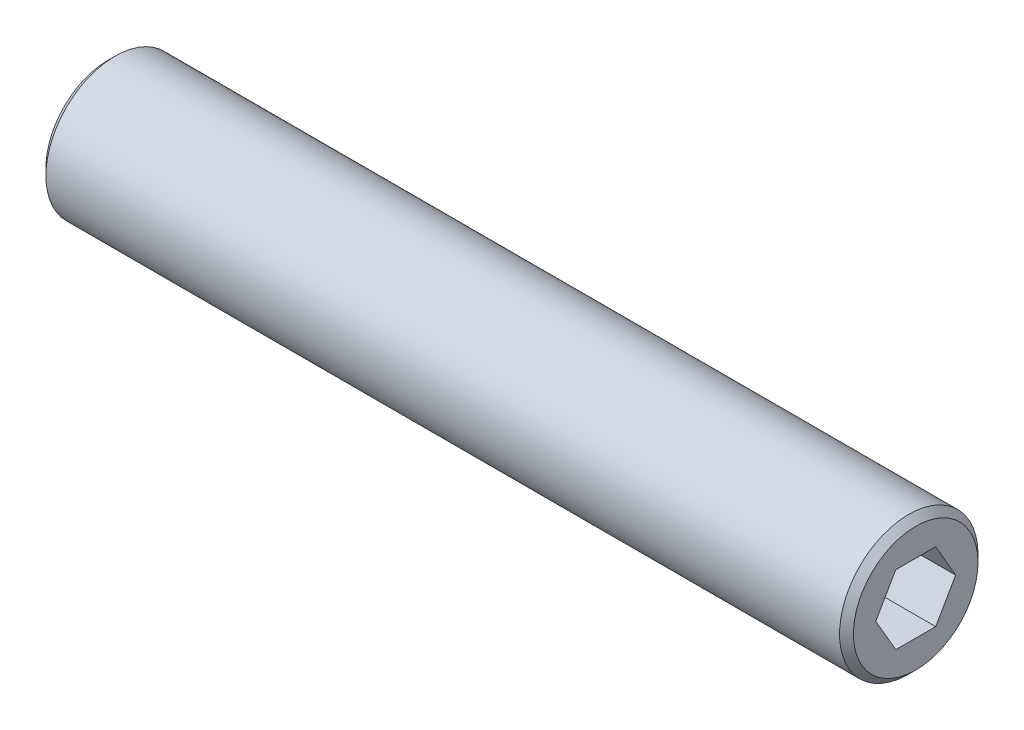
from build123d import *

# Parameters (mm, degrees)
ESQUISSE1_R             = 3
BASE_EXTRUSION_DEPTH    = 17.5
ENL_V_MAT_EXTRU_3_DEPTH = 4
ENL_V_MAT_EXTRU_4_DEPTH = 4
CHANFREIN2_SIZE         = 0.3


with BuildPart() as part:
    # Esquisse1 → Base-Extrusion (new, symmetric)
    with BuildSketch(Plane(origin=(0, 0, 0), x_dir=(0, 0, -1), z_dir=(1, 0, 0))):
        Circle(ESQUISSE1_R)
    extrude(amount=BASE_EXTRUSION_DEPTH, both=True)

    # Esquisse5 → Enl_v. mat.-Extru.3 (cut)
    with BuildSketch(Plane.ZY.offset(17.5)):
        Polygon((1.732050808, 0), (0.866025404, 1.5), (-0.866025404, 1.5), (-1.732050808, 0), (-0.866025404, -1.5), (0.866025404, -1.5), align=None)
    extrude(amount=-ENL_V_MAT_EXTRU_3_DEPTH, mode=Mode.SUBTRACT)

    # Esquisse7 → Enl_v. mat.-Extru.4 (cut)
    with BuildSketch(Plane(origin=(17.5, 0, 0), x_dir=(0, 0, -1), z_dir=(1, 0, 0))):
        Polygon((0.866025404, 1.5), (1.732050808, 0), (0.866025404, -1.5), (-0.866025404, -1.5), (-1.732050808, 0), (-0.866025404, 1.5), align=None)
    extrude(amount=-ENL_V_MAT_EXTRU_4_DEPTH, mode=Mode.SUBTRACT)

    # Chanfrein2
    chanfrein2_edges = [part.edges().sort_by_distance(p)[0] for p in [
        (-17.5, 0, 3),
        (17.5, 0, 3),
    ]]
    chamfer(chanfrein2_edges, length=CHANFREIN2_SIZE)


solid = part.part
